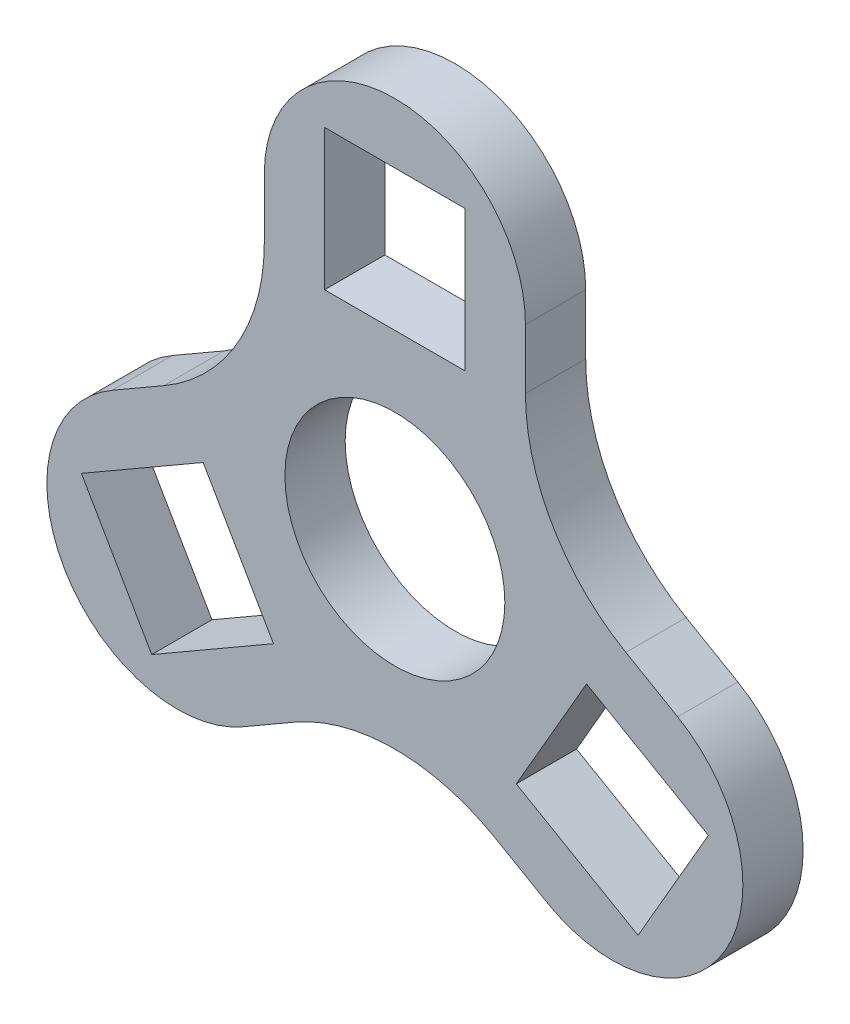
ISO-10303-21;
HEADER;
FILE_DESCRIPTION(('STEP AP214'),'2;1');
FILE_NAME('part.step','',(''),(''),'','','');
FILE_SCHEMA(('AUTOMOTIVE_DESIGN { 1 0 10303 214 1 1 1 1 }'));
ENDSEC;
DATA;
#1=APPLICATION_CONTEXT('core data for automotive mechanical design processes');
#2=APPLICATION_PROTOCOL_DEFINITION('international standard','automotive_design',2000,#1);
#3=PRODUCT_CONTEXT('',#1,'mechanical');
#4=PRODUCT('Part','Part','',(#3));
#5=PRODUCT_RELATED_PRODUCT_CATEGORY('part','',(#4));
#6=PRODUCT_DEFINITION_FORMATION('','',#4);
#7=PRODUCT_DEFINITION_CONTEXT('part definition',#1,'design');
#8=PRODUCT_DEFINITION('design','',#6,#7);
#9=PRODUCT_DEFINITION_SHAPE('','',#8);
#10=(LENGTH_UNIT() NAMED_UNIT(*) SI_UNIT(.MILLI.,.METRE.));
#11=(NAMED_UNIT(*) PLANE_ANGLE_UNIT() SI_UNIT($,.RADIAN.));
#12=(NAMED_UNIT(*) SI_UNIT($,.STERADIAN.) SOLID_ANGLE_UNIT());
#13=UNCERTAINTY_MEASURE_WITH_UNIT(LENGTH_MEASURE(1.E-05),#10,'distance_accuracy_value','');
#14=(GEOMETRIC_REPRESENTATION_CONTEXT(3) GLOBAL_UNCERTAINTY_ASSIGNED_CONTEXT((#13)) GLOBAL_UNIT_ASSIGNED_CONTEXT((#10,
#11,#12)) REPRESENTATION_CONTEXT('',''));
#15=CARTESIAN_POINT('',(0.,0.,0.));
#16=DIRECTION('',(0.,0.,1.));
#17=DIRECTION('',(1.,0.,0.));
#18=AXIS2_PLACEMENT_3D('',#15,#16,#17);
#19=CARTESIAN_POINT('',(0.,25.,3.));
#20=DIRECTION('',(0.,0.,1.));
#21=DIRECTION('',(1.,0.,0.));
#22=AXIS2_PLACEMENT_3D('',#19,#20,#21);
#23=PLANE('',#22);
#24=CARTESIAN_POINT('',(0.,25.,3.));
#25=DIRECTION('',(0.,0.,1.));
#26=DIRECTION('',(1.,0.,0.));
#27=AXIS2_PLACEMENT_3D('',#24,#25,#26);
#28=CIRCLE('',#27,13.);
#29=CARTESIAN_POINT('',(13.,25.,3.));
#30=VERTEX_POINT('',#29);
#31=CARTESIAN_POINT('',(-13.,25.,3.));
#32=VERTEX_POINT('',#31);
#33=EDGE_CURVE('E359',#30,#32,#28,.T.);
#34=ORIENTED_EDGE('',*,*,#33,.T.);
#35=DIRECTION('',(0.,-1.,0.));
#36=VECTOR('',#35,1.);
#37=CARTESIAN_POINT('',(-13.,25.,3.));
#38=LINE('',#37,#36);
#39=CARTESIAN_POINT('',(-13.,19.052558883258,3.));
#40=VERTEX_POINT('',#39);
#41=EDGE_CURVE('E363',#32,#40,#38,.T.);
#42=ORIENTED_EDGE('',*,*,#41,.T.);
#43=CARTESIAN_POINT('',(-33.,19.052558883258,3.));
#44=DIRECTION('',(0.,0.,1.));
#45=DIRECTION('',(1.,0.,0.));
#46=AXIS2_PLACEMENT_3D('',#43,#44,#45);
#47=CIRCLE('',#46,20.);
#48=CARTESIAN_POINT('',(-23.,1.7320508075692,3.));
#49=VERTEX_POINT('',#48);
#50=EDGE_CURVE('E465',#40,#49,#47,.F.);
#51=ORIENTED_EDGE('',*,*,#50,.T.);
#52=DIRECTION('',(-0.866025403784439,-0.5,0.));
#53=VECTOR('',#52,1.);
#54=CARTESIAN_POINT('',(-28.1506350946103,-1.2416697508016,3.));
#55=LINE('',#54,#53);
#56=CARTESIAN_POINT('',(-28.1506350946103,-1.2416697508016,3.));
#57=VERTEX_POINT('',#56);
#58=EDGE_CURVE('E368',#49,#57,#55,.T.);
#59=ORIENTED_EDGE('',*,*,#58,.T.);
#60=CARTESIAN_POINT('',(-21.6506350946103,-12.4999999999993,3.));
#61=DIRECTION('',(0.,0.,1.));
#62=DIRECTION('',(1.,0.,0.));
#63=AXIS2_PLACEMENT_3D('',#60,#61,#62);
#64=CIRCLE('',#63,13.);
#65=CARTESIAN_POINT('',(-15.1506350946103,-23.758330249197,3.));
#66=VERTEX_POINT('',#65);
#67=EDGE_CURVE('E371',#57,#66,#64,.T.);
#68=ORIENTED_EDGE('',*,*,#67,.T.);
#69=DIRECTION('',(0.866025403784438,0.5,0.));
#70=VECTOR('',#69,1.);
#71=CARTESIAN_POINT('',(-15.1506350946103,-23.758330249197,3.));
#72=LINE('',#71,#70);
#73=CARTESIAN_POINT('',(-9.99999999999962,-20.784609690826,3.));
#74=VERTEX_POINT('',#73);
#75=EDGE_CURVE('E374',#66,#74,#72,.T.);
#76=ORIENTED_EDGE('',*,*,#75,.T.);
#77=CARTESIAN_POINT('',(3.90312782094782E-13,-38.1051177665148,3.));
#78=DIRECTION('',(0.,0.,1.));
#79=DIRECTION('',(1.,0.,0.));
#80=AXIS2_PLACEMENT_3D('',#77,#78,#79);
#81=CIRCLE('',#80,20.);
#82=CARTESIAN_POINT('',(10.0000000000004,-20.784609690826,3.));
#83=VERTEX_POINT('',#82);
#84=EDGE_CURVE('E471',#74,#83,#81,.F.);
#85=ORIENTED_EDGE('',*,*,#84,.T.);
#86=DIRECTION('',(0.866025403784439,-0.5,0.));
#87=VECTOR('',#86,1.);
#88=CARTESIAN_POINT('',(15.1506350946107,-23.7583302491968,3.));
#89=LINE('',#88,#87);
#90=CARTESIAN_POINT('',(15.1506350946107,-23.7583302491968,3.));
#91=VERTEX_POINT('',#90);
#92=EDGE_CURVE('E378',#83,#91,#89,.T.);
#93=ORIENTED_EDGE('',*,*,#92,.T.);
#94=CARTESIAN_POINT('',(21.6506350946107,-12.4999999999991,3.));
#95=DIRECTION('',(0.,0.,1.));
#96=DIRECTION('',(1.,0.,0.));
#97=AXIS2_PLACEMENT_3D('',#94,#95,#96);
#98=CIRCLE('',#97,13.);
#99=CARTESIAN_POINT('',(28.1506350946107,-1.24166975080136,3.));
#100=VERTEX_POINT('',#99);
#101=EDGE_CURVE('E381',#91,#100,#98,.T.);
#102=ORIENTED_EDGE('',*,*,#101,.T.);
#103=DIRECTION('',(-0.866025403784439,0.499999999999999,0.));
#104=VECTOR('',#103,1.);
#105=CARTESIAN_POINT('',(28.1506350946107,-1.24166975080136,3.));
#106=LINE('',#105,#104);
#107=CARTESIAN_POINT('',(23.,1.73205080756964,3.));
#108=VERTEX_POINT('',#107);
#109=EDGE_CURVE('E384',#100,#108,#106,.T.);
#110=ORIENTED_EDGE('',*,*,#109,.T.);
#111=CARTESIAN_POINT('',(33.,19.0525588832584,3.));
#112=DIRECTION('',(0.,0.,1.));
#113=DIRECTION('',(1.,0.,0.));
#114=AXIS2_PLACEMENT_3D('',#111,#112,#113);
#115=CIRCLE('',#114,20.);
#116=CARTESIAN_POINT('',(13.,19.0525588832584,3.));
#117=VERTEX_POINT('',#116);
#118=EDGE_CURVE('E11',#108,#117,#115,.F.);
#119=ORIENTED_EDGE('',*,*,#118,.T.);
#120=DIRECTION('',(0.,1.,0.));
#121=VECTOR('',#120,1.);
#122=CARTESIAN_POINT('',(13.,25.,3.));
#123=LINE('',#122,#121);
#124=EDGE_CURVE('E387',#117,#30,#123,.T.);
#125=ORIENTED_EDGE('',*,*,#124,.T.);
#126=EDGE_LOOP('',(#34,#42,#51,#59,#68,#76,#85,#93,#102,#110,#119,#125));
#127=FACE_BOUND('',#126,.T.);
#128=CARTESIAN_POINT('',(0.,0.,3.));
#129=DIRECTION('',(0.,0.,1.));
#130=DIRECTION('',(1.,0.,0.));
#131=AXIS2_PLACEMENT_3D('',#128,#129,#130);
#132=CIRCLE('',#131,10.95);
#133=CARTESIAN_POINT('',(10.95,0.,3.));
#134=VERTEX_POINT('',#133);
#135=EDGE_CURVE('E351',#134,#134,#132,.T.);
#136=ORIENTED_EDGE('',*,*,#135,.F.);
#137=EDGE_LOOP('',(#136));
#138=FACE_BOUND('',#137,.T.);
#139=DIRECTION('',(-1.,0.,0.));
#140=VECTOR('',#139,1.);
#141=CARTESIAN_POINT('',(-7.,32.,3.));
#142=LINE('',#141,#140);
#143=CARTESIAN_POINT('',(7.,32.,3.));
#144=VERTEX_POINT('',#143);
#145=CARTESIAN_POINT('',(-7.,32.,3.));
#146=VERTEX_POINT('',#145);
#147=EDGE_CURVE('E311',#144,#146,#142,.T.);
#148=ORIENTED_EDGE('',*,*,#147,.F.);
#149=DIRECTION('',(0.,1.,0.));
#150=VECTOR('',#149,1.);
#151=CARTESIAN_POINT('',(7.,32.,3.));
#152=LINE('',#151,#150);
#153=CARTESIAN_POINT('',(7.,18.,3.));
#154=VERTEX_POINT('',#153);
#155=EDGE_CURVE('E308',#154,#144,#152,.T.);
#156=ORIENTED_EDGE('',*,*,#155,.F.);
#157=DIRECTION('',(1.,0.,0.));
#158=VECTOR('',#157,1.);
#159=CARTESIAN_POINT('',(-7.,18.,3.));
#160=LINE('',#159,#158);
#161=CARTESIAN_POINT('',(-7.,18.,3.));
#162=VERTEX_POINT('',#161);
#163=EDGE_CURVE('E319',#162,#154,#160,.T.);
#164=ORIENTED_EDGE('',*,*,#163,.F.);
#165=DIRECTION('',(0.,-1.,0.));
#166=VECTOR('',#165,1.);
#167=CARTESIAN_POINT('',(-7.,32.,3.));
#168=LINE('',#167,#166);
#169=EDGE_CURVE('E315',#146,#162,#168,.T.);
#170=ORIENTED_EDGE('',*,*,#169,.F.);
#171=EDGE_LOOP('',(#148,#156,#164,#170));
#172=FACE_BOUND('',#171,.T.);
#173=DIRECTION('',(0.866025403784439,-0.5,0.));
#174=VECTOR('',#173,1.);
#175=CARTESIAN_POINT('',(24.2128129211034,-22.0621778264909,3.));
#176=LINE('',#175,#174);
#177=CARTESIAN_POINT('',(12.0884572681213,-15.0621778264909,3.));
#178=VERTEX_POINT('',#177);
#179=CARTESIAN_POINT('',(24.2128129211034,-22.0621778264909,3.));
#180=VERTEX_POINT('',#179);
#181=EDGE_CURVE('E268',#178,#180,#176,.T.);
#182=ORIENTED_EDGE('',*,*,#181,.F.);
#183=DIRECTION('',(-0.5,-0.866025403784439,0.));
#184=VECTOR('',#183,1.);
#185=CARTESIAN_POINT('',(19.0884572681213,-2.93782217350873,3.));
#186=LINE('',#185,#184);
#187=CARTESIAN_POINT('',(19.0884572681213,-2.93782217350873,3.));
#188=VERTEX_POINT('',#187);
#189=EDGE_CURVE('E265',#188,#178,#186,.T.);
#190=ORIENTED_EDGE('',*,*,#189,.F.);
#191=DIRECTION('',(-0.866025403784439,0.5,0.));
#192=VECTOR('',#191,1.);
#193=CARTESIAN_POINT('',(31.2128129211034,-9.93782217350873,3.));
#194=LINE('',#193,#192);
#195=CARTESIAN_POINT('',(31.2128129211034,-9.93782217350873,3.));
#196=VERTEX_POINT('',#195);
#197=EDGE_CURVE('E276',#196,#188,#194,.T.);
#198=ORIENTED_EDGE('',*,*,#197,.F.);
#199=DIRECTION('',(0.5,0.866025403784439,0.));
#200=VECTOR('',#199,1.);
#201=CARTESIAN_POINT('',(31.2128129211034,-9.93782217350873,3.));
#202=LINE('',#201,#200);
#203=EDGE_CURVE('E272',#180,#196,#202,.T.);
#204=ORIENTED_EDGE('',*,*,#203,.F.);
#205=EDGE_LOOP('',(#182,#190,#198,#204));
#206=FACE_BOUND('',#205,.T.);
#207=DIRECTION('',(-0.866025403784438,-0.500000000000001,0.));
#208=VECTOR('',#207,1.);
#209=CARTESIAN_POINT('',(-31.2128129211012,-9.93782217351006,3.));
#210=LINE('',#209,#208);
#211=CARTESIAN_POINT('',(-19.088457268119,-2.93782217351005,3.));
#212=VERTEX_POINT('',#211);
#213=CARTESIAN_POINT('',(-31.2128129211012,-9.93782217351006,3.));
#214=VERTEX_POINT('',#213);
#215=EDGE_CURVE('E221',#212,#214,#210,.T.);
#216=ORIENTED_EDGE('',*,*,#215,.F.);
#217=DIRECTION('',(-0.5,0.866025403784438,0.));
#218=VECTOR('',#217,1.);
#219=CARTESIAN_POINT('',(-12.088457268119,-15.0621778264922,3.));
#220=LINE('',#219,#218);
#221=CARTESIAN_POINT('',(-12.088457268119,-15.0621778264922,3.));
#222=VERTEX_POINT('',#221);
#223=EDGE_CURVE('E210',#222,#212,#220,.T.);
#224=ORIENTED_EDGE('',*,*,#223,.F.);
#225=DIRECTION('',(0.866025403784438,0.500000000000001,0.));
#226=VECTOR('',#225,1.);
#227=CARTESIAN_POINT('',(-24.2128129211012,-22.0621778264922,3.));
#228=LINE('',#227,#226);
#229=CARTESIAN_POINT('',(-24.2128129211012,-22.0621778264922,3.));
#230=VERTEX_POINT('',#229);
#231=EDGE_CURVE('E241',#230,#222,#228,.T.);
#232=ORIENTED_EDGE('',*,*,#231,.F.);
#233=DIRECTION('',(0.5,-0.866025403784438,0.));
#234=VECTOR('',#233,1.);
#235=CARTESIAN_POINT('',(-24.2128129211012,-22.0621778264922,3.));
#236=LINE('',#235,#234);
#237=EDGE_CURVE('E235',#214,#230,#236,.T.);
#238=ORIENTED_EDGE('',*,*,#237,.F.);
#239=EDGE_LOOP('',(#216,#224,#232,#238));
#240=FACE_BOUND('',#239,.T.);
#241=ADVANCED_FACE('F47',(#127,#138,#172,#206,#240),#23,.T.);
#242=CARTESIAN_POINT('',(0.,25.,-3.));
#243=DIRECTION('',(0.,0.,1.));
#244=DIRECTION('',(1.,0.,0.));
#245=AXIS2_PLACEMENT_3D('',#242,#243,#244);
#246=PLANE('',#245);
#247=DIRECTION('',(-0.5,-0.866025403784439,0.));
#248=VECTOR('',#247,1.);
#249=CARTESIAN_POINT('',(19.0884572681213,-2.93782217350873,-3.));
#250=LINE('',#249,#248);
#251=CARTESIAN_POINT('',(19.0884572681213,-2.93782217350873,-3.));
#252=VERTEX_POINT('',#251);
#253=CARTESIAN_POINT('',(12.0884572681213,-15.0621778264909,-3.));
#254=VERTEX_POINT('',#253);
#255=EDGE_CURVE('E230',#252,#254,#250,.T.);
#256=ORIENTED_EDGE('',*,*,#255,.T.);
#257=DIRECTION('',(0.866025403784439,-0.5,0.));
#258=VECTOR('',#257,1.);
#259=CARTESIAN_POINT('',(24.2128129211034,-22.0621778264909,-3.));
#260=LINE('',#259,#258);
#261=CARTESIAN_POINT('',(24.2128129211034,-22.0621778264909,-3.));
#262=VERTEX_POINT('',#261);
#263=EDGE_CURVE('E283',#254,#262,#260,.T.);
#264=ORIENTED_EDGE('',*,*,#263,.T.);
#265=DIRECTION('',(0.5,0.866025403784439,0.));
#266=VECTOR('',#265,1.);
#267=CARTESIAN_POINT('',(31.2128129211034,-9.93782217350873,-3.));
#268=LINE('',#267,#266);
#269=CARTESIAN_POINT('',(31.2128129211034,-9.93782217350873,-3.));
#270=VERTEX_POINT('',#269);
#271=EDGE_CURVE('E287',#262,#270,#268,.T.);
#272=ORIENTED_EDGE('',*,*,#271,.T.);
#273=DIRECTION('',(-0.866025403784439,0.5,0.));
#274=VECTOR('',#273,1.);
#275=CARTESIAN_POINT('',(31.2128129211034,-9.93782217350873,-3.));
#276=LINE('',#275,#274);
#277=EDGE_CURVE('E269',#270,#252,#276,.T.);
#278=ORIENTED_EDGE('',*,*,#277,.T.);
#279=EDGE_LOOP('',(#256,#264,#272,#278));
#280=FACE_BOUND('',#279,.T.);
#281=CARTESIAN_POINT('',(0.,0.,-3.));
#282=DIRECTION('',(0.,0.,1.));
#283=DIRECTION('',(1.,0.,0.));
#284=AXIS2_PLACEMENT_3D('',#281,#282,#283);
#285=CIRCLE('',#284,10.95);
#286=CARTESIAN_POINT('',(10.95,0.,-3.));
#287=VERTEX_POINT('',#286);
#288=EDGE_CURVE('E350',#287,#287,#285,.T.);
#289=ORIENTED_EDGE('',*,*,#288,.T.);
#290=EDGE_LOOP('',(#289));
#291=FACE_BOUND('',#290,.T.);
#292=CARTESIAN_POINT('',(0.,25.,-3.));
#293=DIRECTION('',(0.,0.,1.));
#294=DIRECTION('',(1.,0.,0.));
#295=AXIS2_PLACEMENT_3D('',#292,#293,#294);
#296=CIRCLE('',#295,13.);
#297=CARTESIAN_POINT('',(13.,25.,-3.));
#298=VERTEX_POINT('',#297);
#299=CARTESIAN_POINT('',(-13.,25.,-3.));
#300=VERTEX_POINT('',#299);
#301=EDGE_CURVE('E355',#298,#300,#296,.T.);
#302=ORIENTED_EDGE('',*,*,#301,.F.);
#303=DIRECTION('',(0.,1.,0.));
#304=VECTOR('',#303,1.);
#305=CARTESIAN_POINT('',(13.,25.,-3.));
#306=LINE('',#305,#304);
#307=CARTESIAN_POINT('',(13.,19.0525588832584,-3.));
#308=VERTEX_POINT('',#307);
#309=EDGE_CURVE('E364',#308,#298,#306,.T.);
#310=ORIENTED_EDGE('',*,*,#309,.F.);
#311=CARTESIAN_POINT('',(33.,19.0525588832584,-3.));
#312=DIRECTION('',(0.,0.,1.));
#313=DIRECTION('',(1.,0.,0.));
#314=AXIS2_PLACEMENT_3D('',#311,#312,#313);
#315=CIRCLE('',#314,20.);
#316=CARTESIAN_POINT('',(23.,1.73205080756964,-3.));
#317=VERTEX_POINT('',#316);
#318=EDGE_CURVE('E56',#308,#317,#315,.T.);
#319=ORIENTED_EDGE('',*,*,#318,.T.);
#320=DIRECTION('',(-0.866025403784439,0.499999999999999,0.));
#321=VECTOR('',#320,1.);
#322=CARTESIAN_POINT('',(28.1506350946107,-1.24166975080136,-3.));
#323=LINE('',#322,#321);
#324=CARTESIAN_POINT('',(28.1506350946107,-1.24166975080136,-3.));
#325=VERTEX_POINT('',#324);
#326=EDGE_CURVE('E414',#325,#317,#323,.T.);
#327=ORIENTED_EDGE('',*,*,#326,.F.);
#328=CARTESIAN_POINT('',(21.6506350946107,-12.4999999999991,-3.));
#329=DIRECTION('',(0.,0.,1.));
#330=DIRECTION('',(1.,0.,0.));
#331=AXIS2_PLACEMENT_3D('',#328,#329,#330);
#332=CIRCLE('',#331,13.);
#333=CARTESIAN_POINT('',(15.1506350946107,-23.7583302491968,-3.));
#334=VERTEX_POINT('',#333);
#335=EDGE_CURVE('E411',#334,#325,#332,.T.);
#336=ORIENTED_EDGE('',*,*,#335,.F.);
#337=DIRECTION('',(0.866025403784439,-0.5,0.));
#338=VECTOR('',#337,1.);
#339=CARTESIAN_POINT('',(15.1506350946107,-23.7583302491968,-3.));
#340=LINE('',#339,#338);
#341=CARTESIAN_POINT('',(10.0000000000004,-20.784609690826,-3.));
#342=VERTEX_POINT('',#341);
#343=EDGE_CURVE('E408',#342,#334,#340,.T.);
#344=ORIENTED_EDGE('',*,*,#343,.F.);
#345=CARTESIAN_POINT('',(3.90312782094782E-13,-38.1051177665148,-3.));
#346=DIRECTION('',(0.,0.,1.));
#347=DIRECTION('',(1.,0.,0.));
#348=AXIS2_PLACEMENT_3D('',#345,#346,#347);
#349=CIRCLE('',#348,20.);
#350=CARTESIAN_POINT('',(-9.99999999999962,-20.784609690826,-3.));
#351=VERTEX_POINT('',#350);
#352=EDGE_CURVE('E468',#342,#351,#349,.T.);
#353=ORIENTED_EDGE('',*,*,#352,.T.);
#354=DIRECTION('',(0.866025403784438,0.5,0.));
#355=VECTOR('',#354,1.);
#356=CARTESIAN_POINT('',(-15.1506350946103,-23.758330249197,-3.));
#357=LINE('',#356,#355);
#358=CARTESIAN_POINT('',(-15.1506350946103,-23.758330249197,-3.));
#359=VERTEX_POINT('',#358);
#360=EDGE_CURVE('E404',#359,#351,#357,.T.);
#361=ORIENTED_EDGE('',*,*,#360,.F.);
#362=CARTESIAN_POINT('',(-21.6506350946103,-12.4999999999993,-3.));
#363=DIRECTION('',(0.,0.,1.));
#364=DIRECTION('',(1.,0.,0.));
#365=AXIS2_PLACEMENT_3D('',#362,#363,#364);
#366=CIRCLE('',#365,13.);
#367=CARTESIAN_POINT('',(-28.1506350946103,-1.2416697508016,-3.));
#368=VERTEX_POINT('',#367);
#369=EDGE_CURVE('E401',#368,#359,#366,.T.);
#370=ORIENTED_EDGE('',*,*,#369,.F.);
#371=DIRECTION('',(-0.866025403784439,-0.5,0.));
#372=VECTOR('',#371,1.);
#373=CARTESIAN_POINT('',(-28.1506350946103,-1.2416697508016,-3.));
#374=LINE('',#373,#372);
#375=CARTESIAN_POINT('',(-23.,1.7320508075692,-3.));
#376=VERTEX_POINT('',#375);
#377=EDGE_CURVE('E398',#376,#368,#374,.T.);
#378=ORIENTED_EDGE('',*,*,#377,.F.);
#379=CARTESIAN_POINT('',(-33.,19.052558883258,-3.));
#380=DIRECTION('',(0.,0.,1.));
#381=DIRECTION('',(1.,0.,0.));
#382=AXIS2_PLACEMENT_3D('',#379,#380,#381);
#383=CIRCLE('',#382,20.);
#384=CARTESIAN_POINT('',(-13.,19.052558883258,-3.));
#385=VERTEX_POINT('',#384);
#386=EDGE_CURVE('E462',#376,#385,#383,.T.);
#387=ORIENTED_EDGE('',*,*,#386,.T.);
#388=DIRECTION('',(0.,-1.,0.));
#389=VECTOR('',#388,1.);
#390=CARTESIAN_POINT('',(-13.,25.,-3.));
#391=LINE('',#390,#389);
#392=EDGE_CURVE('E394',#300,#385,#391,.T.);
#393=ORIENTED_EDGE('',*,*,#392,.F.);
#394=EDGE_LOOP('',(#302,#310,#319,#327,#336,#344,#353,#361,#370,#378,#387,#393));
#395=FACE_BOUND('',#394,.T.);
#396=DIRECTION('',(0.,1.,0.));
#397=VECTOR('',#396,1.);
#398=CARTESIAN_POINT('',(7.,32.,-3.));
#399=LINE('',#398,#397);
#400=CARTESIAN_POINT('',(7.,18.,-3.));
#401=VERTEX_POINT('',#400);
#402=CARTESIAN_POINT('',(7.,32.,-3.));
#403=VERTEX_POINT('',#402);
#404=EDGE_CURVE('E307',#401,#403,#399,.T.);
#405=ORIENTED_EDGE('',*,*,#404,.T.);
#406=DIRECTION('',(-1.,0.,0.));
#407=VECTOR('',#406,1.);
#408=CARTESIAN_POINT('',(-7.,32.,-3.));
#409=LINE('',#408,#407);
#410=CARTESIAN_POINT('',(-7.,32.,-3.));
#411=VERTEX_POINT('',#410);
#412=EDGE_CURVE('E326',#403,#411,#409,.T.);
#413=ORIENTED_EDGE('',*,*,#412,.T.);
#414=DIRECTION('',(0.,-1.,0.));
#415=VECTOR('',#414,1.);
#416=CARTESIAN_POINT('',(-7.,32.,-3.));
#417=LINE('',#416,#415);
#418=CARTESIAN_POINT('',(-7.,18.,-3.));
#419=VERTEX_POINT('',#418);
#420=EDGE_CURVE('E330',#411,#419,#417,.T.);
#421=ORIENTED_EDGE('',*,*,#420,.T.);
#422=DIRECTION('',(1.,0.,0.));
#423=VECTOR('',#422,1.);
#424=CARTESIAN_POINT('',(-7.,18.,-3.));
#425=LINE('',#424,#423);
#426=EDGE_CURVE('E312',#419,#401,#425,.T.);
#427=ORIENTED_EDGE('',*,*,#426,.T.);
#428=EDGE_LOOP('',(#405,#413,#421,#427));
#429=FACE_BOUND('',#428,.T.);
#430=DIRECTION('',(-0.5,0.866025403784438,0.));
#431=VECTOR('',#430,1.);
#432=CARTESIAN_POINT('',(-12.088457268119,-15.0621778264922,-3.));
#433=LINE('',#432,#431);
#434=CARTESIAN_POINT('',(-12.088457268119,-15.0621778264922,-3.));
#435=VERTEX_POINT('',#434);
#436=CARTESIAN_POINT('',(-19.088457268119,-2.93782217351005,-3.));
#437=VERTEX_POINT('',#436);
#438=EDGE_CURVE('E246',#435,#437,#433,.T.);
#439=ORIENTED_EDGE('',*,*,#438,.T.);
#440=DIRECTION('',(-0.866025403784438,-0.500000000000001,0.));
#441=VECTOR('',#440,1.);
#442=CARTESIAN_POINT('',(-31.2128129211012,-9.93782217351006,-3.));
#443=LINE('',#442,#441);
#444=CARTESIAN_POINT('',(-31.2128129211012,-9.93782217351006,-3.));
#445=VERTEX_POINT('',#444);
#446=EDGE_CURVE('E228',#437,#445,#443,.T.);
#447=ORIENTED_EDGE('',*,*,#446,.T.);
#448=DIRECTION('',(0.5,-0.866025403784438,0.));
#449=VECTOR('',#448,1.);
#450=CARTESIAN_POINT('',(-24.2128129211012,-22.0621778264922,-3.));
#451=LINE('',#450,#449);
#452=CARTESIAN_POINT('',(-24.2128129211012,-22.0621778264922,-3.));
#453=VERTEX_POINT('',#452);
#454=EDGE_CURVE('E251',#445,#453,#451,.T.);
#455=ORIENTED_EDGE('',*,*,#454,.T.);
#456=DIRECTION('',(0.866025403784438,0.500000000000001,0.));
#457=VECTOR('',#456,1.);
#458=CARTESIAN_POINT('',(-24.2128129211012,-22.0621778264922,-3.));
#459=LINE('',#458,#457);
#460=EDGE_CURVE('E222',#453,#435,#459,.T.);
#461=ORIENTED_EDGE('',*,*,#460,.T.);
#462=EDGE_LOOP('',(#439,#447,#455,#461));
#463=FACE_BOUND('',#462,.T.);
#464=ADVANCED_FACE('F636',(#280,#291,#395,#429,#463),#246,.F.);
#465=CARTESIAN_POINT('',(0.,25.,3.));
#466=DIRECTION('',(0.,0.,-1.));
#467=DIRECTION('',(-1.,0.,0.));
#468=AXIS2_PLACEMENT_3D('',#465,#466,#467);
#469=CYLINDRICAL_SURFACE('',#468,13.);
#470=ORIENTED_EDGE('',*,*,#301,.T.);
#471=DIRECTION('',(0.,0.,-1.));
#472=VECTOR('',#471,1.);
#473=CARTESIAN_POINT('',(-13.,25.,3.));
#474=LINE('',#473,#472);
#475=EDGE_CURVE('E438',#32,#300,#474,.T.);
#476=ORIENTED_EDGE('',*,*,#475,.F.);
#477=ORIENTED_EDGE('',*,*,#33,.F.);
#478=DIRECTION('',(0.,0.,-1.));
#479=VECTOR('',#478,1.);
#480=CARTESIAN_POINT('',(13.,25.,3.));
#481=LINE('',#480,#479);
#482=EDGE_CURVE('E390',#30,#298,#481,.T.);
#483=ORIENTED_EDGE('',*,*,#482,.T.);
#484=EDGE_LOOP('',(#470,#476,#477,#483));
#485=FACE_BOUND('',#484,.T.);
#486=ADVANCED_FACE('F663',(#485),#469,.T.);
#487=CARTESIAN_POINT('',(-13.,25.,3.));
#488=DIRECTION('',(1.,0.,0.));
#489=DIRECTION('',(0.,1.,0.));
#490=AXIS2_PLACEMENT_3D('',#487,#488,#489);
#491=PLANE('',#490);
#492=ORIENTED_EDGE('',*,*,#392,.T.);
#493=DIRECTION('',(0.,0.,-1.));
#494=VECTOR('',#493,1.);
#495=CARTESIAN_POINT('',(-13.,19.052558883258,3.));
#496=LINE('',#495,#494);
#497=EDGE_CURVE('E446',#385,#40,#496,.F.);
#498=ORIENTED_EDGE('',*,*,#497,.T.);
#499=ORIENTED_EDGE('',*,*,#41,.F.);
#500=ORIENTED_EDGE('',*,*,#475,.T.);
#501=EDGE_LOOP('',(#492,#498,#499,#500));
#502=FACE_BOUND('',#501,.T.);
#503=ADVANCED_FACE('F657',(#502),#491,.F.);
#504=CARTESIAN_POINT('',(-28.1506350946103,-1.2416697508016,3.));
#505=DIRECTION('',(0.5,-0.866025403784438,0.));
#506=DIRECTION('',(0.866025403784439,0.5,0.));
#507=AXIS2_PLACEMENT_3D('',#504,#505,#506);
#508=PLANE('',#507);
#509=ORIENTED_EDGE('',*,*,#58,.F.);
#510=DIRECTION('',(0.,0.,-1.));
#511=VECTOR('',#510,1.);
#512=CARTESIAN_POINT('',(-23.,1.7320508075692,-3.));
#513=LINE('',#512,#511);
#514=EDGE_CURVE('E442',#49,#376,#513,.T.);
#515=ORIENTED_EDGE('',*,*,#514,.T.);
#516=ORIENTED_EDGE('',*,*,#377,.T.);
#517=DIRECTION('',(0.,0.,-1.));
#518=VECTOR('',#517,1.);
#519=CARTESIAN_POINT('',(-28.1506350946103,-1.2416697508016,3.));
#520=LINE('',#519,#518);
#521=EDGE_CURVE('E434',#57,#368,#520,.T.);
#522=ORIENTED_EDGE('',*,*,#521,.F.);
#523=EDGE_LOOP('',(#509,#515,#516,#522));
#524=FACE_BOUND('',#523,.T.);
#525=ADVANCED_FACE('F650',(#524),#508,.F.);
#526=CARTESIAN_POINT('',(-21.6506350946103,-12.4999999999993,3.));
#527=DIRECTION('',(0.,0.,-1.));
#528=DIRECTION('',(-1.,0.,0.));
#529=AXIS2_PLACEMENT_3D('',#526,#527,#528);
#530=CYLINDRICAL_SURFACE('',#529,13.);
#531=ORIENTED_EDGE('',*,*,#369,.T.);
#532=DIRECTION('',(0.,0.,-1.));
#533=VECTOR('',#532,1.);
#534=CARTESIAN_POINT('',(-15.1506350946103,-23.758330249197,3.));
#535=LINE('',#534,#533);
#536=EDGE_CURVE('E430',#66,#359,#535,.T.);
#537=ORIENTED_EDGE('',*,*,#536,.F.);
#538=ORIENTED_EDGE('',*,*,#67,.F.);
#539=ORIENTED_EDGE('',*,*,#521,.T.);
#540=EDGE_LOOP('',(#531,#537,#538,#539));
#541=FACE_BOUND('',#540,.T.);
#542=ADVANCED_FACE('F645',(#541),#530,.T.);
#543=CARTESIAN_POINT('',(-15.1506350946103,-23.758330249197,3.));
#544=DIRECTION('',(-0.500000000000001,0.866025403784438,0.));
#545=DIRECTION('',(-0.866025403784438,-0.500000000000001,0.));
#546=AXIS2_PLACEMENT_3D('',#543,#544,#545);
#547=PLANE('',#546);
#548=ORIENTED_EDGE('',*,*,#360,.T.);
#549=DIRECTION('',(0.,0.,-1.));
#550=VECTOR('',#549,1.);
#551=CARTESIAN_POINT('',(-9.99999999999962,-20.784609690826,3.));
#552=LINE('',#551,#550);
#553=EDGE_CURVE('E453',#351,#74,#552,.F.);
#554=ORIENTED_EDGE('',*,*,#553,.T.);
#555=ORIENTED_EDGE('',*,*,#75,.F.);
#556=ORIENTED_EDGE('',*,*,#536,.T.);
#557=EDGE_LOOP('',(#548,#554,#555,#556));
#558=FACE_BOUND('',#557,.T.);
#559=ADVANCED_FACE('F641',(#558),#547,.F.);
#560=CARTESIAN_POINT('',(15.1506350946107,-23.7583302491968,3.));
#561=DIRECTION('',(0.5,0.866025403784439,0.));
#562=DIRECTION('',(-0.866025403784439,0.5,0.));
#563=AXIS2_PLACEMENT_3D('',#560,#561,#562);
#564=PLANE('',#563);
#565=ORIENTED_EDGE('',*,*,#92,.F.);
#566=DIRECTION('',(0.,0.,-1.));
#567=VECTOR('',#566,1.);
#568=CARTESIAN_POINT('',(10.0000000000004,-20.784609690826,-3.));
#569=LINE('',#568,#567);
#570=EDGE_CURVE('E449',#83,#342,#569,.T.);
#571=ORIENTED_EDGE('',*,*,#570,.T.);
#572=ORIENTED_EDGE('',*,*,#343,.T.);
#573=DIRECTION('',(0.,0.,-1.));
#574=VECTOR('',#573,1.);
#575=CARTESIAN_POINT('',(15.1506350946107,-23.7583302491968,3.));
#576=LINE('',#575,#574);
#577=EDGE_CURVE('E426',#91,#334,#576,.T.);
#578=ORIENTED_EDGE('',*,*,#577,.F.);
#579=EDGE_LOOP('',(#565,#571,#572,#578));
#580=FACE_BOUND('',#579,.T.);
#581=ADVANCED_FACE('F630',(#580),#564,.F.);
#582=CARTESIAN_POINT('',(21.6506350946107,-12.4999999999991,3.));
#583=DIRECTION('',(0.,0.,-1.));
#584=DIRECTION('',(-1.,0.,0.));
#585=AXIS2_PLACEMENT_3D('',#582,#583,#584);
#586=CYLINDRICAL_SURFACE('',#585,13.);
#587=ORIENTED_EDGE('',*,*,#335,.T.);
#588=DIRECTION('',(0.,0.,-1.));
#589=VECTOR('',#588,1.);
#590=CARTESIAN_POINT('',(28.1506350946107,-1.24166975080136,3.));
#591=LINE('',#590,#589);
#592=EDGE_CURVE('E422',#100,#325,#591,.T.);
#593=ORIENTED_EDGE('',*,*,#592,.F.);
#594=ORIENTED_EDGE('',*,*,#101,.F.);
#595=ORIENTED_EDGE('',*,*,#577,.T.);
#596=EDGE_LOOP('',(#587,#593,#594,#595));
#597=FACE_BOUND('',#596,.T.);
#598=ADVANCED_FACE('F672',(#597),#586,.T.);
#599=CARTESIAN_POINT('',(28.1506350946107,-1.24166975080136,3.));
#600=DIRECTION('',(-0.5,-0.866025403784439,0.));
#601=DIRECTION('',(0.866025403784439,-0.5,0.));
#602=AXIS2_PLACEMENT_3D('',#599,#600,#601);
#603=PLANE('',#602);
#604=ORIENTED_EDGE('',*,*,#326,.T.);
#605=DIRECTION('',(0.,0.,-1.));
#606=VECTOR('',#605,1.);
#607=CARTESIAN_POINT('',(23.,1.73205080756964,3.));
#608=LINE('',#607,#606);
#609=EDGE_CURVE('E63',#317,#108,#608,.F.);
#610=ORIENTED_EDGE('',*,*,#609,.T.);
#611=ORIENTED_EDGE('',*,*,#109,.F.);
#612=ORIENTED_EDGE('',*,*,#592,.T.);
#613=EDGE_LOOP('',(#604,#610,#611,#612));
#614=FACE_BOUND('',#613,.T.);
#615=ADVANCED_FACE('F670',(#614),#603,.F.);
#616=CARTESIAN_POINT('',(13.,25.,3.));
#617=DIRECTION('',(-1.,0.,0.));
#618=DIRECTION('',(0.,-1.,0.));
#619=AXIS2_PLACEMENT_3D('',#616,#617,#618);
#620=PLANE('',#619);
#621=ORIENTED_EDGE('',*,*,#124,.F.);
#622=DIRECTION('',(0.,0.,-1.));
#623=VECTOR('',#622,1.);
#624=CARTESIAN_POINT('',(13.,19.0525588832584,-3.));
#625=LINE('',#624,#623);
#626=EDGE_CURVE('E456',#117,#308,#625,.T.);
#627=ORIENTED_EDGE('',*,*,#626,.T.);
#628=ORIENTED_EDGE('',*,*,#309,.T.);
#629=ORIENTED_EDGE('',*,*,#482,.F.);
#630=EDGE_LOOP('',(#621,#627,#628,#629));
#631=FACE_BOUND('',#630,.T.);
#632=ADVANCED_FACE('F665',(#631),#620,.F.);
#633=CARTESIAN_POINT('',(0.,0.,3.));
#634=DIRECTION('',(0.,0.,-1.));
#635=DIRECTION('',(-1.,0.,0.));
#636=AXIS2_PLACEMENT_3D('',#633,#634,#635);
#637=CYLINDRICAL_SURFACE('',#636,10.95);
#638=ORIENTED_EDGE('',*,*,#135,.T.);
#639=EDGE_LOOP('',(#638));
#640=FACE_BOUND('',#639,.T.);
#641=ORIENTED_EDGE('',*,*,#288,.F.);
#642=EDGE_LOOP('',(#641));
#643=FACE_BOUND('',#642,.T.);
#644=ADVANCED_FACE('F689',(#640,#643),#637,.F.);
#645=CARTESIAN_POINT('',(7.,32.,3.));
#646=DIRECTION('',(-1.,0.,0.));
#647=DIRECTION('',(0.,-1.,0.));
#648=AXIS2_PLACEMENT_3D('',#645,#646,#647);
#649=PLANE('',#648);
#650=ORIENTED_EDGE('',*,*,#404,.F.);
#651=DIRECTION('',(0.,0.,-1.));
#652=VECTOR('',#651,1.);
#653=CARTESIAN_POINT('',(7.,18.,3.));
#654=LINE('',#653,#652);
#655=EDGE_CURVE('E322',#154,#401,#654,.T.);
#656=ORIENTED_EDGE('',*,*,#655,.F.);
#657=ORIENTED_EDGE('',*,*,#155,.T.);
#658=DIRECTION('',(0.,0.,-1.));
#659=VECTOR('',#658,1.);
#660=CARTESIAN_POINT('',(7.,32.,3.));
#661=LINE('',#660,#659);
#662=EDGE_CURVE('E346',#144,#403,#661,.T.);
#663=ORIENTED_EDGE('',*,*,#662,.T.);
#664=EDGE_LOOP('',(#650,#656,#657,#663));
#665=FACE_BOUND('',#664,.T.);
#666=ADVANCED_FACE('F696',(#665),#649,.T.);
#667=CARTESIAN_POINT('',(-7.,32.,3.));
#668=DIRECTION('',(0.,-1.,0.));
#669=DIRECTION('',(0.,0.,-1.));
#670=AXIS2_PLACEMENT_3D('',#667,#668,#669);
#671=PLANE('',#670);
#672=ORIENTED_EDGE('',*,*,#412,.F.);
#673=ORIENTED_EDGE('',*,*,#662,.F.);
#674=ORIENTED_EDGE('',*,*,#147,.T.);
#675=DIRECTION('',(0.,0.,-1.));
#676=VECTOR('',#675,1.);
#677=CARTESIAN_POINT('',(-7.,32.,3.));
#678=LINE('',#677,#676);
#679=EDGE_CURVE('E343',#146,#411,#678,.T.);
#680=ORIENTED_EDGE('',*,*,#679,.T.);
#681=EDGE_LOOP('',(#672,#673,#674,#680));
#682=FACE_BOUND('',#681,.T.);
#683=ADVANCED_FACE('F701',(#682),#671,.T.);
#684=CARTESIAN_POINT('',(-7.,32.,3.));
#685=DIRECTION('',(1.,0.,0.));
#686=DIRECTION('',(0.,1.,0.));
#687=AXIS2_PLACEMENT_3D('',#684,#685,#686);
#688=PLANE('',#687);
#689=ORIENTED_EDGE('',*,*,#420,.F.);
#690=ORIENTED_EDGE('',*,*,#679,.F.);
#691=ORIENTED_EDGE('',*,*,#169,.T.);
#692=DIRECTION('',(0.,0.,-1.));
#693=VECTOR('',#692,1.);
#694=CARTESIAN_POINT('',(-7.,18.,3.));
#695=LINE('',#694,#693);
#696=EDGE_CURVE('E340',#162,#419,#695,.T.);
#697=ORIENTED_EDGE('',*,*,#696,.T.);
#698=EDGE_LOOP('',(#689,#690,#691,#697));
#699=FACE_BOUND('',#698,.T.);
#700=ADVANCED_FACE('F746',(#699),#688,.T.);
#701=CARTESIAN_POINT('',(-7.,18.,3.));
#702=DIRECTION('',(0.,1.,0.));
#703=DIRECTION('',(0.,0.,1.));
#704=AXIS2_PLACEMENT_3D('',#701,#702,#703);
#705=PLANE('',#704);
#706=ORIENTED_EDGE('',*,*,#426,.F.);
#707=ORIENTED_EDGE('',*,*,#696,.F.);
#708=ORIENTED_EDGE('',*,*,#163,.T.);
#709=ORIENTED_EDGE('',*,*,#655,.T.);
#710=EDGE_LOOP('',(#706,#707,#708,#709));
#711=FACE_BOUND('',#710,.T.);
#712=ADVANCED_FACE('F743',(#711),#705,.T.);
#713=CARTESIAN_POINT('',(19.0884572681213,-2.93782217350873,3.));
#714=DIRECTION('',(0.866025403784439,-0.5,0.));
#715=DIRECTION('',(0.5,0.866025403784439,0.));
#716=AXIS2_PLACEMENT_3D('',#713,#714,#715);
#717=PLANE('',#716);
#718=ORIENTED_EDGE('',*,*,#255,.F.);
#719=DIRECTION('',(0.,0.,-1.));
#720=VECTOR('',#719,1.);
#721=CARTESIAN_POINT('',(19.0884572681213,-2.93782217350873,3.));
#722=LINE('',#721,#720);
#723=EDGE_CURVE('E279',#188,#252,#722,.T.);
#724=ORIENTED_EDGE('',*,*,#723,.F.);
#725=ORIENTED_EDGE('',*,*,#189,.T.);
#726=DIRECTION('',(0.,0.,-1.));
#727=VECTOR('',#726,1.);
#728=CARTESIAN_POINT('',(12.0884572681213,-15.0621778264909,3.));
#729=LINE('',#728,#727);
#730=EDGE_CURVE('E303',#178,#254,#729,.T.);
#731=ORIENTED_EDGE('',*,*,#730,.T.);
#732=EDGE_LOOP('',(#718,#724,#725,#731));
#733=FACE_BOUND('',#732,.T.);
#734=ADVANCED_FACE('F725',(#733),#717,.T.);
#735=CARTESIAN_POINT('',(24.2128129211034,-22.0621778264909,3.));
#736=DIRECTION('',(0.5,0.866025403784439,0.));
#737=DIRECTION('',(-0.866025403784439,0.5,0.));
#738=AXIS2_PLACEMENT_3D('',#735,#736,#737);
#739=PLANE('',#738);
#740=ORIENTED_EDGE('',*,*,#263,.F.);
#741=ORIENTED_EDGE('',*,*,#730,.F.);
#742=ORIENTED_EDGE('',*,*,#181,.T.);
#743=DIRECTION('',(0.,0.,-1.));
#744=VECTOR('',#743,1.);
#745=CARTESIAN_POINT('',(24.2128129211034,-22.0621778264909,3.));
#746=LINE('',#745,#744);
#747=EDGE_CURVE('E300',#180,#262,#746,.T.);
#748=ORIENTED_EDGE('',*,*,#747,.T.);
#749=EDGE_LOOP('',(#740,#741,#742,#748));
#750=FACE_BOUND('',#749,.T.);
#751=ADVANCED_FACE('F719',(#750),#739,.T.);
#752=CARTESIAN_POINT('',(31.2128129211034,-9.93782217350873,3.));
#753=DIRECTION('',(-0.866025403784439,0.5,0.));
#754=DIRECTION('',(-0.5,-0.866025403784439,0.));
#755=AXIS2_PLACEMENT_3D('',#752,#753,#754);
#756=PLANE('',#755);
#757=ORIENTED_EDGE('',*,*,#271,.F.);
#758=ORIENTED_EDGE('',*,*,#747,.F.);
#759=ORIENTED_EDGE('',*,*,#203,.T.);
#760=DIRECTION('',(0.,0.,-1.));
#761=VECTOR('',#760,1.);
#762=CARTESIAN_POINT('',(31.2128129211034,-9.93782217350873,3.));
#763=LINE('',#762,#761);
#764=EDGE_CURVE('E297',#196,#270,#763,.T.);
#765=ORIENTED_EDGE('',*,*,#764,.T.);
#766=EDGE_LOOP('',(#757,#758,#759,#765));
#767=FACE_BOUND('',#766,.T.);
#768=ADVANCED_FACE('F722',(#767),#756,.T.);
#769=CARTESIAN_POINT('',(31.2128129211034,-9.93782217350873,3.));
#770=DIRECTION('',(-0.5,-0.866025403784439,0.));
#771=DIRECTION('',(0.866025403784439,-0.5,0.));
#772=AXIS2_PLACEMENT_3D('',#769,#770,#771);
#773=PLANE('',#772);
#774=ORIENTED_EDGE('',*,*,#277,.F.);
#775=ORIENTED_EDGE('',*,*,#764,.F.);
#776=ORIENTED_EDGE('',*,*,#197,.T.);
#777=ORIENTED_EDGE('',*,*,#723,.T.);
#778=EDGE_LOOP('',(#774,#775,#776,#777));
#779=FACE_BOUND('',#778,.T.);
#780=ADVANCED_FACE('F728',(#779),#773,.T.);
#781=CARTESIAN_POINT('',(-12.088457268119,-15.0621778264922,3.));
#782=DIRECTION('',(-0.866025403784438,-0.5,0.));
#783=DIRECTION('',(0.5,-0.866025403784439,0.));
#784=AXIS2_PLACEMENT_3D('',#781,#782,#783);
#785=PLANE('',#784);
#786=ORIENTED_EDGE('',*,*,#438,.F.);
#787=DIRECTION('',(0.,0.,-1.));
#788=VECTOR('',#787,1.);
#789=CARTESIAN_POINT('',(-12.088457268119,-15.0621778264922,3.));
#790=LINE('',#789,#788);
#791=EDGE_CURVE('E216',#222,#435,#790,.T.);
#792=ORIENTED_EDGE('',*,*,#791,.F.);
#793=ORIENTED_EDGE('',*,*,#223,.T.);
#794=DIRECTION('',(0.,0.,-1.));
#795=VECTOR('',#794,1.);
#796=CARTESIAN_POINT('',(-19.088457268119,-2.93782217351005,3.));
#797=LINE('',#796,#795);
#798=EDGE_CURVE('E213',#212,#437,#797,.T.);
#799=ORIENTED_EDGE('',*,*,#798,.T.);
#800=EDGE_LOOP('',(#786,#792,#793,#799));
#801=FACE_BOUND('',#800,.T.);
#802=ADVANCED_FACE('F212',(#801),#785,.T.);
#803=CARTESIAN_POINT('',(-31.2128129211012,-9.93782217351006,3.));
#804=DIRECTION('',(0.5,-0.866025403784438,0.));
#805=DIRECTION('',(0.866025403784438,0.500000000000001,0.));
#806=AXIS2_PLACEMENT_3D('',#803,#804,#805);
#807=PLANE('',#806);
#808=ORIENTED_EDGE('',*,*,#446,.F.);
#809=ORIENTED_EDGE('',*,*,#798,.F.);
#810=ORIENTED_EDGE('',*,*,#215,.T.);
#811=DIRECTION('',(0.,0.,-1.));
#812=VECTOR('',#811,1.);
#813=CARTESIAN_POINT('',(-31.2128129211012,-9.93782217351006,3.));
#814=LINE('',#813,#812);
#815=EDGE_CURVE('E231',#214,#445,#814,.T.);
#816=ORIENTED_EDGE('',*,*,#815,.T.);
#817=EDGE_LOOP('',(#808,#809,#810,#816));
#818=FACE_BOUND('',#817,.T.);
#819=ADVANCED_FACE('F225',(#818),#807,.T.);
#820=CARTESIAN_POINT('',(-24.2128129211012,-22.0621778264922,3.));
#821=DIRECTION('',(0.866025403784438,0.5,0.));
#822=DIRECTION('',(-0.5,0.866025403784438,0.));
#823=AXIS2_PLACEMENT_3D('',#820,#821,#822);
#824=PLANE('',#823);
#825=ORIENTED_EDGE('',*,*,#454,.F.);
#826=ORIENTED_EDGE('',*,*,#815,.F.);
#827=ORIENTED_EDGE('',*,*,#237,.T.);
#828=DIRECTION('',(0.,0.,-1.));
#829=VECTOR('',#828,1.);
#830=CARTESIAN_POINT('',(-24.2128129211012,-22.0621778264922,3.));
#831=LINE('',#830,#829);
#832=EDGE_CURVE('E260',#230,#453,#831,.T.);
#833=ORIENTED_EDGE('',*,*,#832,.T.);
#834=EDGE_LOOP('',(#825,#826,#827,#833));
#835=FACE_BOUND('',#834,.T.);
#836=ADVANCED_FACE('F767',(#835),#824,.T.);
#837=CARTESIAN_POINT('',(-24.2128129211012,-22.0621778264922,3.));
#838=DIRECTION('',(-0.500000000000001,0.866025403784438,0.));
#839=DIRECTION('',(-0.866025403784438,-0.500000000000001,0.));
#840=AXIS2_PLACEMENT_3D('',#837,#838,#839);
#841=PLANE('',#840);
#842=ORIENTED_EDGE('',*,*,#460,.F.);
#843=ORIENTED_EDGE('',*,*,#832,.F.);
#844=ORIENTED_EDGE('',*,*,#231,.T.);
#845=ORIENTED_EDGE('',*,*,#791,.T.);
#846=EDGE_LOOP('',(#842,#843,#844,#845));
#847=FACE_BOUND('',#846,.T.);
#848=ADVANCED_FACE('F764',(#847),#841,.T.);
#849=CARTESIAN_POINT('',(-33.,19.052558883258,3.));
#850=DIRECTION('',(0.,0.,1.));
#851=DIRECTION('',(1.,0.,0.));
#852=AXIS2_PLACEMENT_3D('',#849,#850,#851);
#853=CYLINDRICAL_SURFACE('',#852,20.);
#854=ORIENTED_EDGE('',*,*,#50,.F.);
#855=ORIENTED_EDGE('',*,*,#497,.F.);
#856=ORIENTED_EDGE('',*,*,#386,.F.);
#857=ORIENTED_EDGE('',*,*,#514,.F.);
#858=EDGE_LOOP('',(#854,#855,#856,#857));
#859=FACE_BOUND('',#858,.T.);
#860=ADVANCED_FACE('F654',(#859),#853,.F.);
#861=CARTESIAN_POINT('',(3.90312782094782E-13,-38.1051177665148,3.));
#862=DIRECTION('',(0.,0.,1.));
#863=DIRECTION('',(1.,0.,0.));
#864=AXIS2_PLACEMENT_3D('',#861,#862,#863);
#865=CYLINDRICAL_SURFACE('',#864,20.);
#866=ORIENTED_EDGE('',*,*,#84,.F.);
#867=ORIENTED_EDGE('',*,*,#553,.F.);
#868=ORIENTED_EDGE('',*,*,#352,.F.);
#869=ORIENTED_EDGE('',*,*,#570,.F.);
#870=EDGE_LOOP('',(#866,#867,#868,#869));
#871=FACE_BOUND('',#870,.T.);
#872=ADVANCED_FACE('F633',(#871),#865,.F.);
#873=CARTESIAN_POINT('',(33.,19.0525588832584,3.));
#874=DIRECTION('',(0.,0.,1.));
#875=DIRECTION('',(1.,0.,0.));
#876=AXIS2_PLACEMENT_3D('',#873,#874,#875);
#877=CYLINDRICAL_SURFACE('',#876,20.);
#878=ORIENTED_EDGE('',*,*,#118,.F.);
#879=ORIENTED_EDGE('',*,*,#609,.F.);
#880=ORIENTED_EDGE('',*,*,#318,.F.);
#881=ORIENTED_EDGE('',*,*,#626,.F.);
#882=EDGE_LOOP('',(#878,#879,#880,#881));
#883=FACE_BOUND('',#882,.T.);
#884=ADVANCED_FACE('F49',(#883),#877,.F.);
#885=CLOSED_SHELL('',(#241,#464,#486,#503,#525,#542,#559,#581,#598,#615,#632,#644,#666,#683,
#700,#712,#734,#751,#768,#780,#802,#819,#836,#848,#860,#872,#884));
#886=MANIFOLD_SOLID_BREP('B2',#885);
#887=ADVANCED_BREP_SHAPE_REPRESENTATION('',(#18,#886),#14);
#888=SHAPE_DEFINITION_REPRESENTATION(#9,#887);
ENDSEC;
END-ISO-10303-21;
